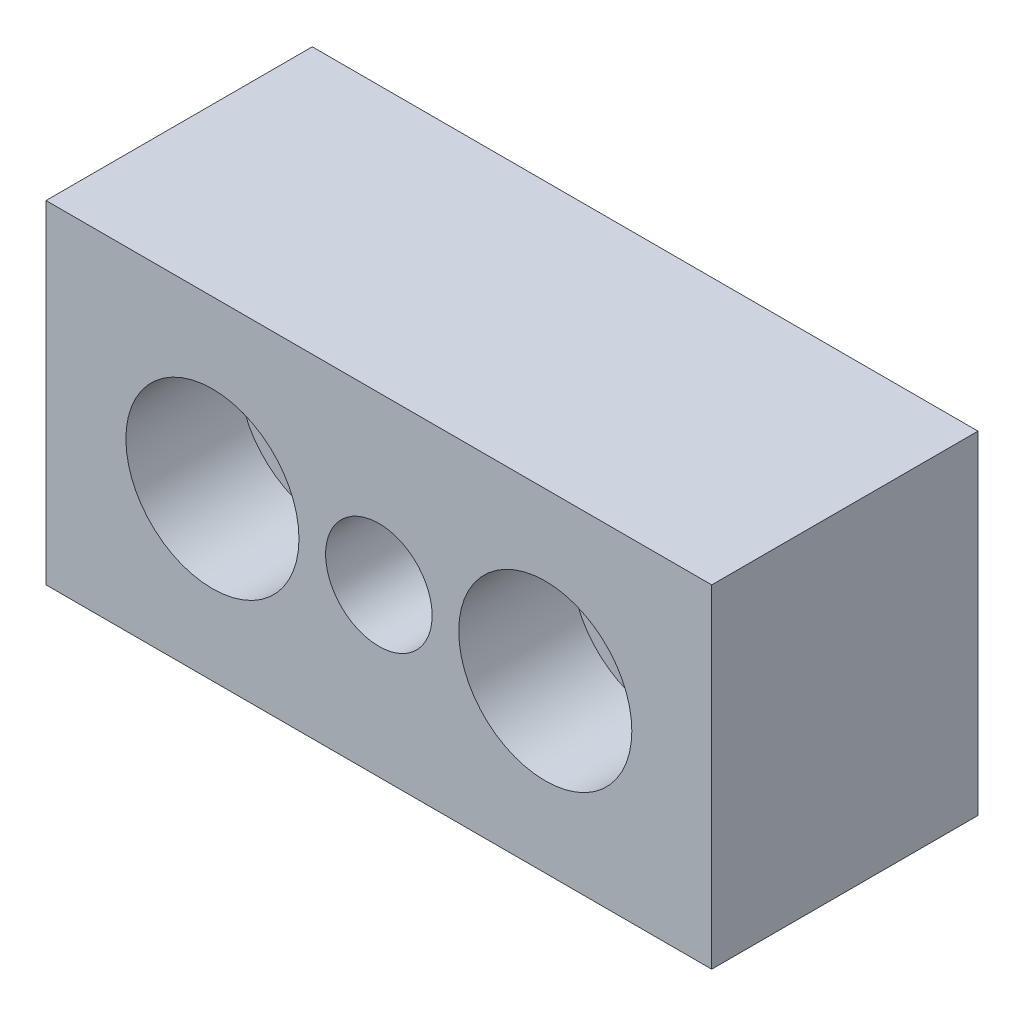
ISO-10303-21;
HEADER;
FILE_DESCRIPTION(('STEP AP214'),'2;1');
FILE_NAME('part.step','',(''),(''),'','','');
FILE_SCHEMA(('AUTOMOTIVE_DESIGN { 1 0 10303 214 1 1 1 1 }'));
ENDSEC;
DATA;
#1=APPLICATION_CONTEXT('core data for automotive mechanical design processes');
#2=APPLICATION_PROTOCOL_DEFINITION('international standard','automotive_design',2000,#1);
#3=PRODUCT_CONTEXT('',#1,'mechanical');
#4=PRODUCT('Part','Part','',(#3));
#5=PRODUCT_RELATED_PRODUCT_CATEGORY('part','',(#4));
#6=PRODUCT_DEFINITION_FORMATION('','',#4);
#7=PRODUCT_DEFINITION_CONTEXT('part definition',#1,'design');
#8=PRODUCT_DEFINITION('design','',#6,#7);
#9=PRODUCT_DEFINITION_SHAPE('','',#8);
#10=(LENGTH_UNIT() NAMED_UNIT(*) SI_UNIT(.MILLI.,.METRE.));
#11=(NAMED_UNIT(*) PLANE_ANGLE_UNIT() SI_UNIT($,.RADIAN.));
#12=(NAMED_UNIT(*) SI_UNIT($,.STERADIAN.) SOLID_ANGLE_UNIT());
#13=UNCERTAINTY_MEASURE_WITH_UNIT(LENGTH_MEASURE(1.E-05),#10,'distance_accuracy_value','');
#14=(GEOMETRIC_REPRESENTATION_CONTEXT(3) GLOBAL_UNCERTAINTY_ASSIGNED_CONTEXT((#13)) GLOBAL_UNIT_ASSIGNED_CONTEXT((#10,
#11,#12)) REPRESENTATION_CONTEXT('',''));
#15=CARTESIAN_POINT('',(0.,0.,0.));
#16=DIRECTION('',(0.,0.,1.));
#17=DIRECTION('',(1.,0.,0.));
#18=AXIS2_PLACEMENT_3D('',#15,#16,#17);
#19=CARTESIAN_POINT('',(-25.,25.,40.));
#20=DIRECTION('',(0.,0.,-1.));
#21=DIRECTION('',(-1.,0.,0.));
#22=AXIS2_PLACEMENT_3D('',#19,#20,#21);
#23=PLANE('',#22);
#24=CARTESIAN_POINT('',(0.,0.,40.));
#25=DIRECTION('',(0.,0.,1.));
#26=DIRECTION('',(1.,0.,0.));
#27=AXIS2_PLACEMENT_3D('',#24,#25,#26);
#28=CIRCLE('',#27,13.);
#29=CARTESIAN_POINT('',(13.,0.,40.));
#30=VERTEX_POINT('',#29);
#31=EDGE_CURVE('E164',#30,#30,#28,.T.);
#32=ORIENTED_EDGE('',*,*,#31,.F.);
#33=EDGE_LOOP('',(#32));
#34=FACE_BOUND('',#33,.T.);
#35=DIRECTION('',(0.,1.,0.));
#36=VECTOR('',#35,1.);
#37=CARTESIAN_POINT('',(-25.,-25.,40.));
#38=LINE('',#37,#36);
#39=CARTESIAN_POINT('',(-25.,-25.,40.));
#40=VERTEX_POINT('',#39);
#41=CARTESIAN_POINT('',(-25.,25.,40.));
#42=VERTEX_POINT('',#41);
#43=EDGE_CURVE('E66',#40,#42,#38,.T.);
#44=ORIENTED_EDGE('',*,*,#43,.F.);
#45=DIRECTION('',(-1.,0.,0.));
#46=VECTOR('',#45,1.);
#47=CARTESIAN_POINT('',(75.,-25.,40.));
#48=LINE('',#47,#46);
#49=CARTESIAN_POINT('',(75.,-25.,40.));
#50=VERTEX_POINT('',#49);
#51=EDGE_CURVE('E48',#50,#40,#48,.T.);
#52=ORIENTED_EDGE('',*,*,#51,.F.);
#53=DIRECTION('',(0.,-1.,0.));
#54=VECTOR('',#53,1.);
#55=CARTESIAN_POINT('',(75.,25.,40.));
#56=LINE('',#55,#54);
#57=CARTESIAN_POINT('',(75.,25.,40.));
#58=VERTEX_POINT('',#57);
#59=EDGE_CURVE('E57',#58,#50,#56,.T.);
#60=ORIENTED_EDGE('',*,*,#59,.F.);
#61=DIRECTION('',(1.,0.,0.));
#62=VECTOR('',#61,1.);
#63=CARTESIAN_POINT('',(-25.,25.,40.));
#64=LINE('',#63,#62);
#65=EDGE_CURVE('E62',#42,#58,#64,.T.);
#66=ORIENTED_EDGE('',*,*,#65,.F.);
#67=EDGE_LOOP('',(#44,#52,#60,#66));
#68=FACE_BOUND('',#67,.T.);
#69=CARTESIAN_POINT('',(25.,0.,40.));
#70=DIRECTION('',(0.,0.,1.));
#71=DIRECTION('',(1.,0.,0.));
#72=AXIS2_PLACEMENT_3D('',#69,#70,#71);
#73=CIRCLE('',#72,8.);
#74=CARTESIAN_POINT('',(33.,0.,40.));
#75=VERTEX_POINT('',#74);
#76=EDGE_CURVE('E84',#75,#75,#73,.T.);
#77=ORIENTED_EDGE('',*,*,#76,.F.);
#78=EDGE_LOOP('',(#77));
#79=FACE_BOUND('',#78,.T.);
#80=CARTESIAN_POINT('',(50.,0.,40.));
#81=DIRECTION('',(0.,0.,1.));
#82=DIRECTION('',(1.,0.,0.));
#83=AXIS2_PLACEMENT_3D('',#80,#81,#82);
#84=CIRCLE('',#83,13.);
#85=CARTESIAN_POINT('',(63.,0.,40.));
#86=VERTEX_POINT('',#85);
#87=EDGE_CURVE('E152',#86,#86,#84,.T.);
#88=ORIENTED_EDGE('',*,*,#87,.F.);
#89=EDGE_LOOP('',(#88));
#90=FACE_BOUND('',#89,.T.);
#91=ADVANCED_FACE('F14',(#34,#68,#79,#90),#23,.F.);
#92=CARTESIAN_POINT('',(-25.,25.,0.));
#93=DIRECTION('',(0.,0.,-1.));
#94=DIRECTION('',(-1.,0.,0.));
#95=AXIS2_PLACEMENT_3D('',#92,#93,#94);
#96=PLANE('',#95);
#97=CARTESIAN_POINT('',(0.,0.,0.));
#98=DIRECTION('',(0.,0.,1.));
#99=DIRECTION('',(1.,0.,0.));
#100=AXIS2_PLACEMENT_3D('',#97,#98,#99);
#101=CIRCLE('',#100,9.);
#102=CARTESIAN_POINT('',(9.,0.,0.));
#103=VERTEX_POINT('',#102);
#104=EDGE_CURVE('E155',#103,#103,#101,.T.);
#105=ORIENTED_EDGE('',*,*,#104,.T.);
#106=EDGE_LOOP('',(#105));
#107=FACE_BOUND('',#106,.T.);
#108=DIRECTION('',(0.,1.,0.));
#109=VECTOR('',#108,1.);
#110=CARTESIAN_POINT('',(-25.,-25.,0.));
#111=LINE('',#110,#109);
#112=CARTESIAN_POINT('',(-25.,-25.,0.));
#113=VERTEX_POINT('',#112);
#114=CARTESIAN_POINT('',(-25.,25.,0.));
#115=VERTEX_POINT('',#114);
#116=EDGE_CURVE('E67',#113,#115,#111,.T.);
#117=ORIENTED_EDGE('',*,*,#116,.T.);
#118=DIRECTION('',(1.,0.,0.));
#119=VECTOR('',#118,1.);
#120=CARTESIAN_POINT('',(-25.,25.,0.));
#121=LINE('',#120,#119);
#122=CARTESIAN_POINT('',(75.,25.,0.));
#123=VERTEX_POINT('',#122);
#124=EDGE_CURVE('E70',#115,#123,#121,.T.);
#125=ORIENTED_EDGE('',*,*,#124,.T.);
#126=DIRECTION('',(0.,-1.,0.));
#127=VECTOR('',#126,1.);
#128=CARTESIAN_POINT('',(75.,25.,0.));
#129=LINE('',#128,#127);
#130=CARTESIAN_POINT('',(75.,-25.,0.));
#131=VERTEX_POINT('',#130);
#132=EDGE_CURVE('E80',#123,#131,#129,.T.);
#133=ORIENTED_EDGE('',*,*,#132,.T.);
#134=DIRECTION('',(-1.,0.,0.));
#135=VECTOR('',#134,1.);
#136=CARTESIAN_POINT('',(75.,-25.,0.));
#137=LINE('',#136,#135);
#138=EDGE_CURVE('E51',#131,#113,#137,.T.);
#139=ORIENTED_EDGE('',*,*,#138,.T.);
#140=EDGE_LOOP('',(#117,#125,#133,#139));
#141=FACE_BOUND('',#140,.T.);
#142=CARTESIAN_POINT('',(25.,0.,0.));
#143=DIRECTION('',(0.,0.,1.));
#144=DIRECTION('',(1.,0.,0.));
#145=AXIS2_PLACEMENT_3D('',#142,#143,#144);
#146=CIRCLE('',#145,8.);
#147=CARTESIAN_POINT('',(33.,0.,0.));
#148=VERTEX_POINT('',#147);
#149=EDGE_CURVE('E167',#148,#148,#146,.T.);
#150=ORIENTED_EDGE('',*,*,#149,.T.);
#151=EDGE_LOOP('',(#150));
#152=FACE_BOUND('',#151,.T.);
#153=CARTESIAN_POINT('',(50.,0.,0.));
#154=DIRECTION('',(0.,0.,1.));
#155=DIRECTION('',(1.,0.,0.));
#156=AXIS2_PLACEMENT_3D('',#153,#154,#155);
#157=CIRCLE('',#156,9.);
#158=CARTESIAN_POINT('',(59.,0.,0.));
#159=VERTEX_POINT('',#158);
#160=EDGE_CURVE('E144',#159,#159,#157,.T.);
#161=ORIENTED_EDGE('',*,*,#160,.T.);
#162=EDGE_LOOP('',(#161));
#163=FACE_BOUND('',#162,.T.);
#164=ADVANCED_FACE('F78',(#107,#141,#152,#163),#96,.T.);
#165=CARTESIAN_POINT('',(-25.,-25.,40.));
#166=DIRECTION('',(-1.,0.,0.));
#167=DIRECTION('',(0.,0.,1.));
#168=AXIS2_PLACEMENT_3D('',#165,#166,#167);
#169=PLANE('',#168);
#170=DIRECTION('',(0.,0.,-1.));
#171=VECTOR('',#170,1.);
#172=CARTESIAN_POINT('',(-25.,-25.,40.));
#173=LINE('',#172,#171);
#174=EDGE_CURVE('E9',#40,#113,#173,.T.);
#175=ORIENTED_EDGE('',*,*,#174,.F.);
#176=ORIENTED_EDGE('',*,*,#43,.T.);
#177=DIRECTION('',(0.,0.,-1.));
#178=VECTOR('',#177,1.);
#179=CARTESIAN_POINT('',(-25.,25.,40.));
#180=LINE('',#179,#178);
#181=EDGE_CURVE('E30',#42,#115,#180,.T.);
#182=ORIENTED_EDGE('',*,*,#181,.T.);
#183=ORIENTED_EDGE('',*,*,#116,.F.);
#184=EDGE_LOOP('',(#175,#176,#182,#183));
#185=FACE_BOUND('',#184,.T.);
#186=ADVANCED_FACE('F88',(#185),#169,.T.);
#187=CARTESIAN_POINT('',(75.,-25.,40.));
#188=DIRECTION('',(0.,-1.,0.));
#189=DIRECTION('',(1.,0.,0.));
#190=AXIS2_PLACEMENT_3D('',#187,#188,#189);
#191=PLANE('',#190);
#192=DIRECTION('',(0.,0.,-1.));
#193=VECTOR('',#192,1.);
#194=CARTESIAN_POINT('',(75.,-25.,40.));
#195=LINE('',#194,#193);
#196=EDGE_CURVE('E23',#50,#131,#195,.T.);
#197=ORIENTED_EDGE('',*,*,#196,.F.);
#198=ORIENTED_EDGE('',*,*,#51,.T.);
#199=ORIENTED_EDGE('',*,*,#174,.T.);
#200=ORIENTED_EDGE('',*,*,#138,.F.);
#201=EDGE_LOOP('',(#197,#198,#199,#200));
#202=FACE_BOUND('',#201,.T.);
#203=ADVANCED_FACE('F16',(#202),#191,.T.);
#204=CARTESIAN_POINT('',(75.,25.,40.));
#205=DIRECTION('',(1.,0.,0.));
#206=DIRECTION('',(0.,1.,0.));
#207=AXIS2_PLACEMENT_3D('',#204,#205,#206);
#208=PLANE('',#207);
#209=DIRECTION('',(0.,0.,-1.));
#210=VECTOR('',#209,1.);
#211=CARTESIAN_POINT('',(75.,25.,40.));
#212=LINE('',#211,#210);
#213=EDGE_CURVE('E55',#58,#123,#212,.T.);
#214=ORIENTED_EDGE('',*,*,#213,.F.);
#215=ORIENTED_EDGE('',*,*,#59,.T.);
#216=ORIENTED_EDGE('',*,*,#196,.T.);
#217=ORIENTED_EDGE('',*,*,#132,.F.);
#218=EDGE_LOOP('',(#214,#215,#216,#217));
#219=FACE_BOUND('',#218,.T.);
#220=ADVANCED_FACE('F58',(#219),#208,.T.);
#221=CARTESIAN_POINT('',(-25.,25.,40.));
#222=DIRECTION('',(0.,1.,0.));
#223=DIRECTION('',(0.,0.,1.));
#224=AXIS2_PLACEMENT_3D('',#221,#222,#223);
#225=PLANE('',#224);
#226=ORIENTED_EDGE('',*,*,#65,.T.);
#227=ORIENTED_EDGE('',*,*,#213,.T.);
#228=ORIENTED_EDGE('',*,*,#124,.F.);
#229=ORIENTED_EDGE('',*,*,#181,.F.);
#230=EDGE_LOOP('',(#226,#227,#228,#229));
#231=FACE_BOUND('',#230,.T.);
#232=ADVANCED_FACE('F76',(#231),#225,.T.);
#233=CARTESIAN_POINT('',(25.,0.,40.));
#234=DIRECTION('',(0.,0.,-1.));
#235=DIRECTION('',(-1.,0.,0.));
#236=AXIS2_PLACEMENT_3D('',#233,#234,#235);
#237=CYLINDRICAL_SURFACE('',#236,8.);
#238=ORIENTED_EDGE('',*,*,#76,.T.);
#239=EDGE_LOOP('',(#238));
#240=FACE_BOUND('',#239,.T.);
#241=ORIENTED_EDGE('',*,*,#149,.F.);
#242=EDGE_LOOP('',(#241));
#243=FACE_BOUND('',#242,.T.);
#244=ADVANCED_FACE('F109',(#240,#243),#237,.F.);
#245=CARTESIAN_POINT('',(0.,0.,40.));
#246=DIRECTION('',(0.,0.,1.));
#247=DIRECTION('',(1.,0.,0.));
#248=AXIS2_PLACEMENT_3D('',#245,#246,#247);
#249=CYLINDRICAL_SURFACE('',#248,13.);
#250=ORIENTED_EDGE('',*,*,#31,.T.);
#251=EDGE_LOOP('',(#250));
#252=FACE_BOUND('',#251,.T.);
#253=CARTESIAN_POINT('',(0.,0.,23.));
#254=DIRECTION('',(0.,0.,1.));
#255=DIRECTION('',(1.,0.,0.));
#256=AXIS2_PLACEMENT_3D('',#253,#254,#255);
#257=CIRCLE('',#256,13.);
#258=CARTESIAN_POINT('',(13.,0.,23.));
#259=VERTEX_POINT('',#258);
#260=EDGE_CURVE('E161',#259,#259,#257,.T.);
#261=ORIENTED_EDGE('',*,*,#260,.F.);
#262=EDGE_LOOP('',(#261));
#263=FACE_BOUND('',#262,.T.);
#264=ADVANCED_FACE('F112',(#252,#263),#249,.F.);
#265=CARTESIAN_POINT('',(9.,0.,23.));
#266=DIRECTION('',(0.,0.,1.));
#267=DIRECTION('',(1.,0.,0.));
#268=AXIS2_PLACEMENT_3D('',#265,#266,#267);
#269=PLANE('',#268);
#270=ORIENTED_EDGE('',*,*,#260,.T.);
#271=EDGE_LOOP('',(#270));
#272=FACE_BOUND('',#271,.T.);
#273=CARTESIAN_POINT('',(0.,0.,23.));
#274=DIRECTION('',(0.,0.,1.));
#275=DIRECTION('',(1.,0.,0.));
#276=AXIS2_PLACEMENT_3D('',#273,#274,#275);
#277=CIRCLE('',#276,9.);
#278=CARTESIAN_POINT('',(9.,0.,23.));
#279=VERTEX_POINT('',#278);
#280=EDGE_CURVE('E158',#279,#279,#277,.T.);
#281=ORIENTED_EDGE('',*,*,#280,.F.);
#282=EDGE_LOOP('',(#281));
#283=FACE_BOUND('',#282,.T.);
#284=ADVANCED_FACE('F116',(#272,#283),#269,.T.);
#285=CARTESIAN_POINT('',(0.,0.,40.));
#286=DIRECTION('',(0.,0.,1.));
#287=DIRECTION('',(1.,0.,0.));
#288=AXIS2_PLACEMENT_3D('',#285,#286,#287);
#289=CYLINDRICAL_SURFACE('',#288,9.);
#290=ORIENTED_EDGE('',*,*,#280,.T.);
#291=EDGE_LOOP('',(#290));
#292=FACE_BOUND('',#291,.T.);
#293=ORIENTED_EDGE('',*,*,#104,.F.);
#294=EDGE_LOOP('',(#293));
#295=FACE_BOUND('',#294,.T.);
#296=ADVANCED_FACE('F120',(#292,#295),#289,.F.);
#297=CARTESIAN_POINT('',(50.,0.,40.));
#298=DIRECTION('',(0.,0.,1.));
#299=DIRECTION('',(1.,0.,0.));
#300=AXIS2_PLACEMENT_3D('',#297,#298,#299);
#301=CYLINDRICAL_SURFACE('',#300,13.);
#302=ORIENTED_EDGE('',*,*,#87,.T.);
#303=EDGE_LOOP('',(#302));
#304=FACE_BOUND('',#303,.T.);
#305=CARTESIAN_POINT('',(50.,0.,23.));
#306=DIRECTION('',(0.,0.,1.));
#307=DIRECTION('',(1.,0.,0.));
#308=AXIS2_PLACEMENT_3D('',#305,#306,#307);
#309=CIRCLE('',#308,13.);
#310=CARTESIAN_POINT('',(63.,0.,23.));
#311=VERTEX_POINT('',#310);
#312=EDGE_CURVE('E147',#311,#311,#309,.T.);
#313=ORIENTED_EDGE('',*,*,#312,.F.);
#314=EDGE_LOOP('',(#313));
#315=FACE_BOUND('',#314,.T.);
#316=ADVANCED_FACE('F124',(#304,#315),#301,.F.);
#317=CARTESIAN_POINT('',(59.,0.,23.));
#318=DIRECTION('',(0.,0.,1.));
#319=DIRECTION('',(1.,0.,0.));
#320=AXIS2_PLACEMENT_3D('',#317,#318,#319);
#321=PLANE('',#320);
#322=ORIENTED_EDGE('',*,*,#312,.T.);
#323=EDGE_LOOP('',(#322));
#324=FACE_BOUND('',#323,.T.);
#325=CARTESIAN_POINT('',(50.,0.,23.));
#326=DIRECTION('',(0.,0.,1.));
#327=DIRECTION('',(1.,0.,0.));
#328=AXIS2_PLACEMENT_3D('',#325,#326,#327);
#329=CIRCLE('',#328,9.);
#330=CARTESIAN_POINT('',(59.,0.,23.));
#331=VERTEX_POINT('',#330);
#332=EDGE_CURVE('E141',#331,#331,#329,.T.);
#333=ORIENTED_EDGE('',*,*,#332,.F.);
#334=EDGE_LOOP('',(#333));
#335=FACE_BOUND('',#334,.T.);
#336=ADVANCED_FACE('F128',(#324,#335),#321,.T.);
#337=CARTESIAN_POINT('',(50.,0.,40.));
#338=DIRECTION('',(0.,0.,1.));
#339=DIRECTION('',(1.,0.,0.));
#340=AXIS2_PLACEMENT_3D('',#337,#338,#339);
#341=CYLINDRICAL_SURFACE('',#340,9.);
#342=ORIENTED_EDGE('',*,*,#332,.T.);
#343=EDGE_LOOP('',(#342));
#344=FACE_BOUND('',#343,.T.);
#345=ORIENTED_EDGE('',*,*,#160,.F.);
#346=EDGE_LOOP('',(#345));
#347=FACE_BOUND('',#346,.T.);
#348=ADVANCED_FACE('F132',(#344,#347),#341,.F.);
#349=CLOSED_SHELL('',(#91,#164,#186,#203,#220,#232,#244,#264,#284,#296,#316,#336,#348));
#350=MANIFOLD_SOLID_BREP('B1',#349);
#351=ADVANCED_BREP_SHAPE_REPRESENTATION('',(#18,#350),#14);
#352=SHAPE_DEFINITION_REPRESENTATION(#9,#351);
ENDSEC;
END-ISO-10303-21;
